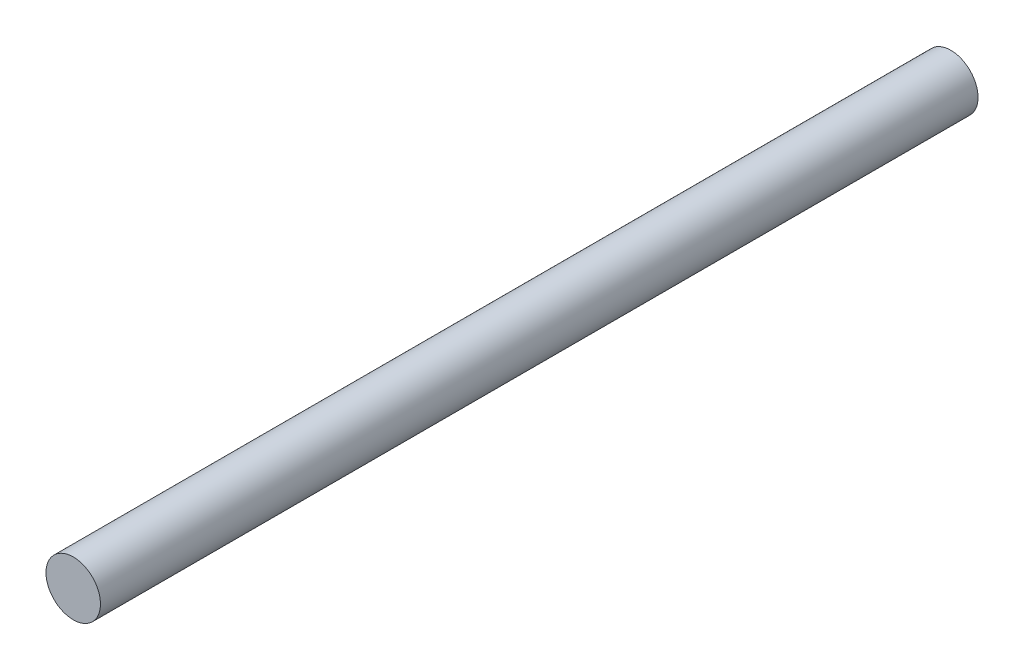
from build123d import *

# Parameters (mm, degrees)
SKIZZE1_R                       = 1.5
AUFSATZ_LINEAR_AUSTRAGEN1_DEPTH = 48.32


with BuildPart() as part:
    # Skizze1 → Aufsatz-Linear austragen1 (new body)
    with BuildSketch(Plane.XY):
        with Locations(Location((0, 0, 0), (0, 0, 180))):
            Circle(SKIZZE1_R)
    extrude(amount=AUFSATZ_LINEAR_AUSTRAGEN1_DEPTH)


solid = part.part
